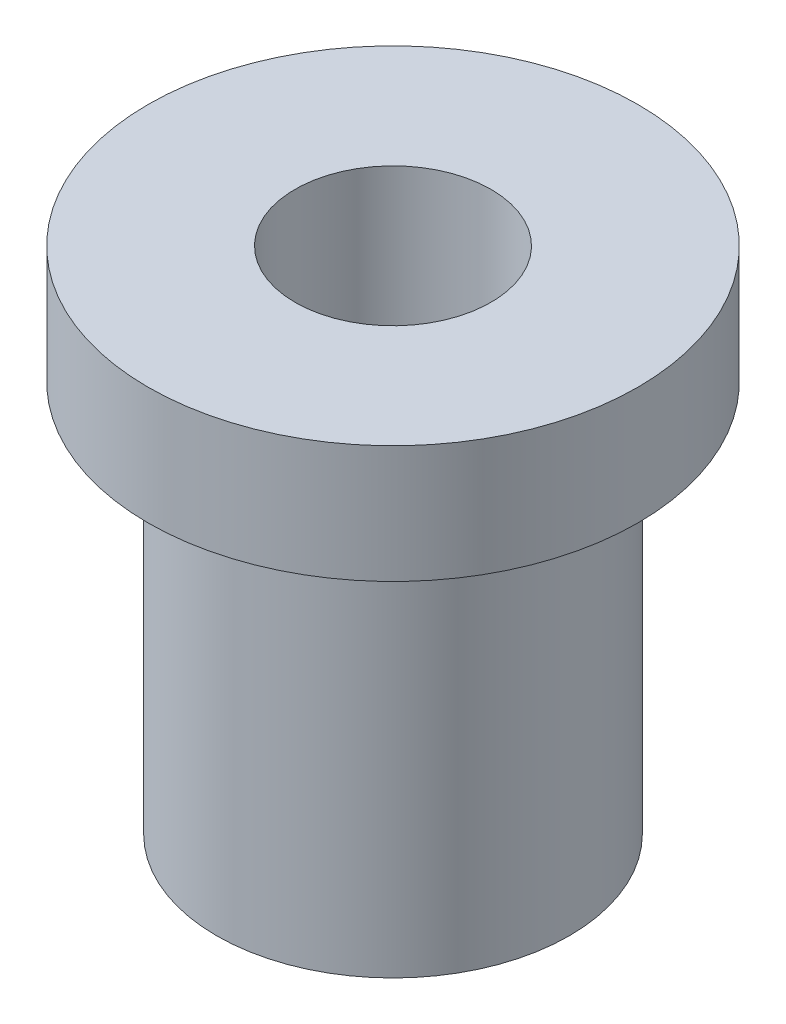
ISO-10303-21;
HEADER;
FILE_DESCRIPTION(('STEP AP214'),'2;1');
FILE_NAME('part.step','',(''),(''),'','','');
FILE_SCHEMA(('AUTOMOTIVE_DESIGN { 1 0 10303 214 1 1 1 1 }'));
ENDSEC;
DATA;
#1=APPLICATION_CONTEXT('core data for automotive mechanical design processes');
#2=APPLICATION_PROTOCOL_DEFINITION('international standard','automotive_design',2000,#1);
#3=PRODUCT_CONTEXT('',#1,'mechanical');
#4=PRODUCT('Part','Part','',(#3));
#5=PRODUCT_RELATED_PRODUCT_CATEGORY('part','',(#4));
#6=PRODUCT_DEFINITION_FORMATION('','',#4);
#7=PRODUCT_DEFINITION_CONTEXT('part definition',#1,'design');
#8=PRODUCT_DEFINITION('design','',#6,#7);
#9=PRODUCT_DEFINITION_SHAPE('','',#8);
#10=(LENGTH_UNIT() NAMED_UNIT(*) SI_UNIT(.MILLI.,.METRE.));
#11=(NAMED_UNIT(*) PLANE_ANGLE_UNIT() SI_UNIT($,.RADIAN.));
#12=(NAMED_UNIT(*) SI_UNIT($,.STERADIAN.) SOLID_ANGLE_UNIT());
#13=UNCERTAINTY_MEASURE_WITH_UNIT(LENGTH_MEASURE(1.E-05),#10,'distance_accuracy_value','');
#14=(GEOMETRIC_REPRESENTATION_CONTEXT(3) GLOBAL_UNCERTAINTY_ASSIGNED_CONTEXT((#13)) GLOBAL_UNIT_ASSIGNED_CONTEXT((#10,
#11,#12)) REPRESENTATION_CONTEXT('',''));
#15=CARTESIAN_POINT('',(0.,0.,0.));
#16=DIRECTION('',(0.,0.,1.));
#17=DIRECTION('',(1.,0.,0.));
#18=AXIS2_PLACEMENT_3D('',#15,#16,#17);
#19=CARTESIAN_POINT('',(9.,0.,0.));
#20=DIRECTION('',(0.,-1.,0.));
#21=DIRECTION('',(0.,0.,-1.));
#22=AXIS2_PLACEMENT_3D('',#19,#20,#21);
#23=PLANE('',#22);
#24=CARTESIAN_POINT('',(0.,0.,0.));
#25=DIRECTION('',(0.,-1.,0.));
#26=DIRECTION('',(0.,0.,-1.));
#27=AXIS2_PLACEMENT_3D('',#24,#25,#26);
#28=CIRCLE('',#27,9.);
#29=CARTESIAN_POINT('',(0.,0.,-9.));
#30=VERTEX_POINT('',#29);
#31=EDGE_CURVE('E53',#30,#30,#28,.T.);
#32=ORIENTED_EDGE('',*,*,#31,.T.);
#33=EDGE_LOOP('',(#32));
#34=FACE_BOUND('',#33,.T.);
#35=CARTESIAN_POINT('',(0.,0.,0.));
#36=DIRECTION('',(0.,-1.,0.));
#37=DIRECTION('',(0.,0.,-1.));
#38=AXIS2_PLACEMENT_3D('',#35,#36,#37);
#39=CIRCLE('',#38,5.);
#40=CARTESIAN_POINT('',(0.,0.,-5.));
#41=VERTEX_POINT('',#40);
#42=EDGE_CURVE('E10',#41,#41,#39,.T.);
#43=ORIENTED_EDGE('',*,*,#42,.F.);
#44=EDGE_LOOP('',(#43));
#45=FACE_BOUND('',#44,.T.);
#46=ADVANCED_FACE('F31',(#34,#45),#23,.T.);
#47=CARTESIAN_POINT('',(0.,0.,0.));
#48=DIRECTION('',(0.,-1.,0.));
#49=DIRECTION('',(0.,0.,-1.));
#50=AXIS2_PLACEMENT_3D('',#47,#48,#49);
#51=CYLINDRICAL_SURFACE('',#50,5.);
#52=ORIENTED_EDGE('',*,*,#42,.T.);
#53=EDGE_LOOP('',(#52));
#54=FACE_BOUND('',#53,.T.);
#55=CARTESIAN_POINT('',(0.,26.,0.));
#56=DIRECTION('',(0.,-1.,0.));
#57=DIRECTION('',(0.,0.,-1.));
#58=AXIS2_PLACEMENT_3D('',#55,#56,#57);
#59=CIRCLE('',#58,5.);
#60=CARTESIAN_POINT('',(0.,26.,-5.));
#61=VERTEX_POINT('',#60);
#62=EDGE_CURVE('E37',#61,#61,#59,.T.);
#63=ORIENTED_EDGE('',*,*,#62,.F.);
#64=EDGE_LOOP('',(#63));
#65=FACE_BOUND('',#64,.T.);
#66=ADVANCED_FACE('F71',(#54,#65),#51,.F.);
#67=CARTESIAN_POINT('',(5.,26.,0.));
#68=DIRECTION('',(0.,1.,0.));
#69=DIRECTION('',(0.,0.,1.));
#70=AXIS2_PLACEMENT_3D('',#67,#68,#69);
#71=PLANE('',#70);
#72=ORIENTED_EDGE('',*,*,#62,.T.);
#73=EDGE_LOOP('',(#72));
#74=FACE_BOUND('',#73,.T.);
#75=CARTESIAN_POINT('',(0.,26.,0.));
#76=DIRECTION('',(0.,-1.,0.));
#77=DIRECTION('',(0.,0.,-1.));
#78=AXIS2_PLACEMENT_3D('',#75,#76,#77);
#79=CIRCLE('',#78,12.5);
#80=CARTESIAN_POINT('',(0.,26.,-12.5));
#81=VERTEX_POINT('',#80);
#82=EDGE_CURVE('E41',#81,#81,#79,.T.);
#83=ORIENTED_EDGE('',*,*,#82,.F.);
#84=EDGE_LOOP('',(#83));
#85=FACE_BOUND('',#84,.T.);
#86=ADVANCED_FACE('F75',(#74,#85),#71,.T.);
#87=CARTESIAN_POINT('',(0.,0.,0.));
#88=DIRECTION('',(0.,-1.,0.));
#89=DIRECTION('',(0.,0.,-1.));
#90=AXIS2_PLACEMENT_3D('',#87,#88,#89);
#91=CYLINDRICAL_SURFACE('',#90,12.5);
#92=ORIENTED_EDGE('',*,*,#82,.T.);
#93=EDGE_LOOP('',(#92));
#94=FACE_BOUND('',#93,.T.);
#95=CARTESIAN_POINT('',(0.,20.,0.));
#96=DIRECTION('',(0.,-1.,0.));
#97=DIRECTION('',(0.,0.,-1.));
#98=AXIS2_PLACEMENT_3D('',#95,#96,#97);
#99=CIRCLE('',#98,12.5);
#100=CARTESIAN_POINT('',(0.,20.,-12.5));
#101=VERTEX_POINT('',#100);
#102=EDGE_CURVE('E45',#101,#101,#99,.T.);
#103=ORIENTED_EDGE('',*,*,#102,.F.);
#104=EDGE_LOOP('',(#103));
#105=FACE_BOUND('',#104,.T.);
#106=ADVANCED_FACE('F67',(#94,#105),#91,.T.);
#107=CARTESIAN_POINT('',(12.5,20.,0.));
#108=DIRECTION('',(0.,-1.,0.));
#109=DIRECTION('',(0.,0.,-1.));
#110=AXIS2_PLACEMENT_3D('',#107,#108,#109);
#111=PLANE('',#110);
#112=ORIENTED_EDGE('',*,*,#102,.T.);
#113=EDGE_LOOP('',(#112));
#114=FACE_BOUND('',#113,.T.);
#115=CARTESIAN_POINT('',(0.,20.,0.));
#116=DIRECTION('',(0.,-1.,0.));
#117=DIRECTION('',(0.,0.,-1.));
#118=AXIS2_PLACEMENT_3D('',#115,#116,#117);
#119=CIRCLE('',#118,9.);
#120=CARTESIAN_POINT('',(0.,20.,-9.));
#121=VERTEX_POINT('',#120);
#122=EDGE_CURVE('E50',#121,#121,#119,.T.);
#123=ORIENTED_EDGE('',*,*,#122,.F.);
#124=EDGE_LOOP('',(#123));
#125=FACE_BOUND('',#124,.T.);
#126=ADVANCED_FACE('F61',(#114,#125),#111,.T.);
#127=CARTESIAN_POINT('',(0.,0.,0.));
#128=DIRECTION('',(0.,-1.,0.));
#129=DIRECTION('',(0.,0.,-1.));
#130=AXIS2_PLACEMENT_3D('',#127,#128,#129);
#131=CYLINDRICAL_SURFACE('',#130,9.);
#132=ORIENTED_EDGE('',*,*,#122,.T.);
#133=EDGE_LOOP('',(#132));
#134=FACE_BOUND('',#133,.T.);
#135=ORIENTED_EDGE('',*,*,#31,.F.);
#136=EDGE_LOOP('',(#135));
#137=FACE_BOUND('',#136,.T.);
#138=ADVANCED_FACE('F59',(#134,#137),#131,.T.);
#139=CLOSED_SHELL('',(#46,#66,#86,#106,#126,#138));
#140=MANIFOLD_SOLID_BREP('B2',#139);
#141=ADVANCED_BREP_SHAPE_REPRESENTATION('',(#18,#140),#14);
#142=SHAPE_DEFINITION_REPRESENTATION(#9,#141);
ENDSEC;
END-ISO-10303-21;
